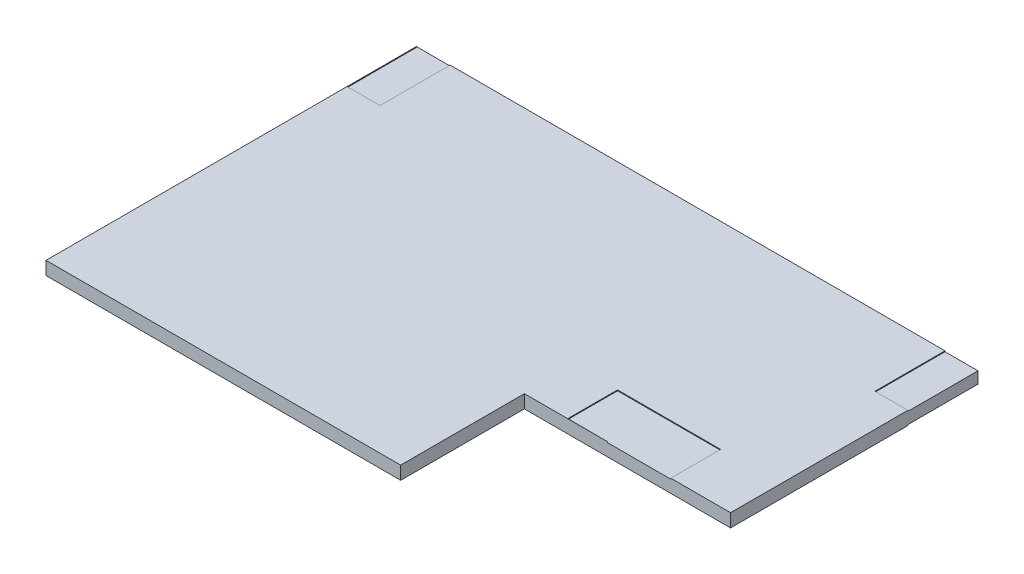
from build123d import *

# Parameters (mm, degrees)
ESQUISSE1_W             = 68
ESQUISSE1_H             = 1.6
EXTRUSION1_DEPTH        = 45
ESQUISSE2_W             = 25
ESQUISSE2_H             = 34
ENL_V_MAT_EXTRU_1_DEPTH = 2
ESQUISSE4_W             = 4.000005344
ESQUISSE4_H             = 8.5
ENL_V_MAT_EXTRU_2_DEPTH = 0.1
ESQUISSE5_W             = 4.000005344
ESQUISSE5_H             = 8.5
ENL_V_MAT_EXTRU_3_DEPTH = 0.1


with BuildPart() as part:
    # Esquisse1 → Extrusion1 (new body)
    with BuildSketch(Plane.XY):
        with Locations((57.011095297, 71.602293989)):
            Rectangle(ESQUISSE1_W, ESQUISSE1_H)
    extrude(amount=EXTRUSION1_DEPTH)

    # Esquisse2 → Enl_v. mat.-Extru.1 (cut)
    with BuildSketch(Plane(origin=(0, 72.402293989, 0), x_dir=(-1, 0, 0), z_dir=(0, 1, 0))):
        with Locations((-78.511095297, 47)):
            Rectangle(ESQUISSE2_W, ESQUISSE2_H)
    extrude(amount=-ENL_V_MAT_EXTRU_1_DEPTH, mode=Mode.SUBTRACT)

    # Esquisse4 → Enl_v. mat.-Extru.2 (cut)
    with BuildSketch(Plane(origin=(0, 72.402293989, 0), x_dir=(-1, 0, 0), z_dir=(0, 1, 0))):
        with Locations((-89.011092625, 4.25)):
            Rectangle(ESQUISSE4_W, ESQUISSE4_H)
        Polygon((-27.011089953, 8.5), (-27.011089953, 0), (-23.011095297, 0), (-23.029811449, 8.5), align=None)
        Polygon((-83.761089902, 23.952607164), (-71.261089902, 23.952607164), (-71.261089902, 29.947835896), (-83.761089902, 30.082433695), align=None)
    extrude(amount=-ENL_V_MAT_EXTRU_2_DEPTH, mode=Mode.SUBTRACT)

    # Esquisse5 → Enl_v. mat.-Extru.3 (cut)
    with BuildSketch(Plane.XZ.offset(-70.802293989)):
        Polygon((23.029811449, 8.5), (23.011095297, 0), (27.011089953, 0), (27.011089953, 8.5), align=None)
        with Locations((89.011092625, 4.25)):
            Rectangle(ESQUISSE5_W, ESQUISSE5_H)
    extrude(amount=-ENL_V_MAT_EXTRU_3_DEPTH, mode=Mode.SUBTRACT)


solid = part.part
